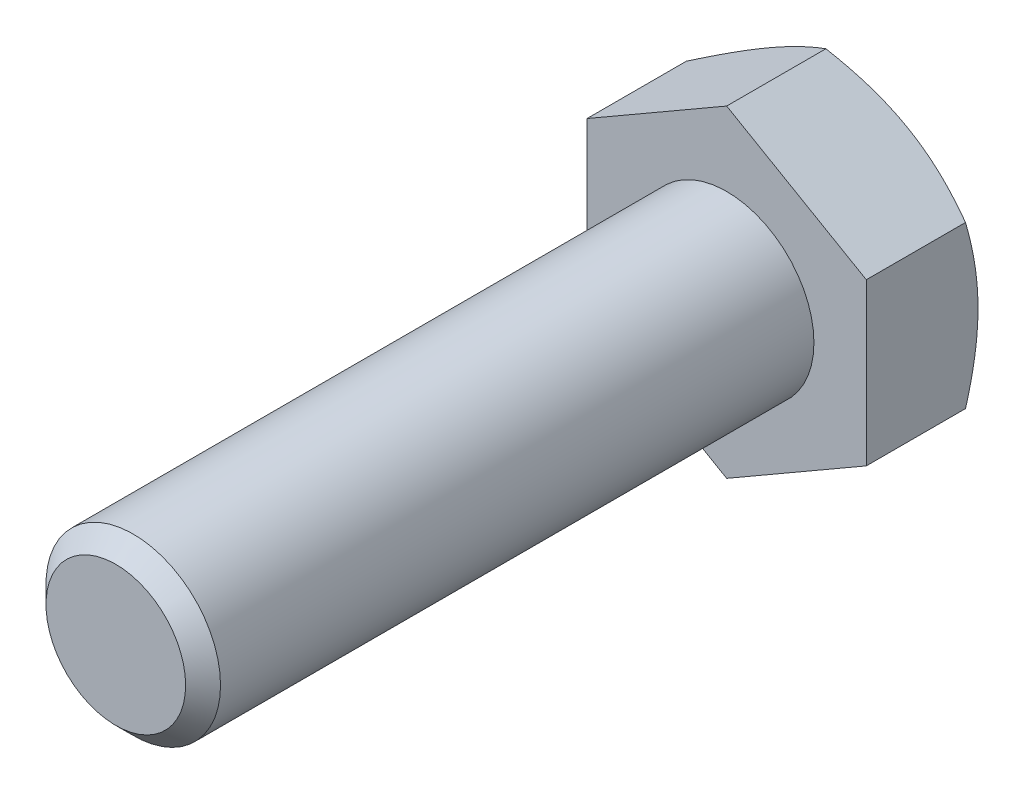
from build123d import *

# Parameters (mm, degrees)
ESQUISSE1_W        = 5
ESQUISSE1_H        = 35
CHANFREIN1_SIZE    = 1
BOSS_EXTRU_1_DEPTH = 6.4


with BuildPart() as part:
    # Esquisse1 → Base-R_volution (revolve)
    with BuildSketch(Plane(origin=(0, 0, 0), x_dir=(1, 0, 0), z_dir=(0, 1, 0))):
        with Locations((2.5, -17.5)):
            Rectangle(ESQUISSE1_W, ESQUISSE1_H)
    revolve(axis=Axis((0, 0, 0), (0, 0, 1)))

    # Chanfrein1
    chanfrein1_edges = [part.edges().sort_by_distance(p)[0] for p in [
        (-5, 0, 35),
    ]]
    chamfer(chanfrein1_edges, length=CHANFREIN1_SIZE)

    # Esquisse6 → Boss.-Extru.1 (add)
    with BuildSketch(Plane.XY):
        Polygon((8, -4.618802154), (8, 4.618802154), (0, 9.237604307), (-8, 4.618802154), (-8, -4.618802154), (0, -9.237604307), align=None)
    extrude(amount=-BOSS_EXTRU_1_DEPTH)

    # Esquisse7 → Enl_vement de mati_re-R_volution1 (revolve, cut)
    with BuildSketch(Plane(origin=(0, 0, 0), x_dir=(1, 0, 0), z_dir=(0, 1, 0))):
        Polygon((-8, 6.4), (-19.085125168, 6.4), (-19.085125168, 0), align=None)
    revolve(axis=Axis((0, 0, -6.239446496), (0, 0, 1)), mode=Mode.SUBTRACT)


solid = part.part
